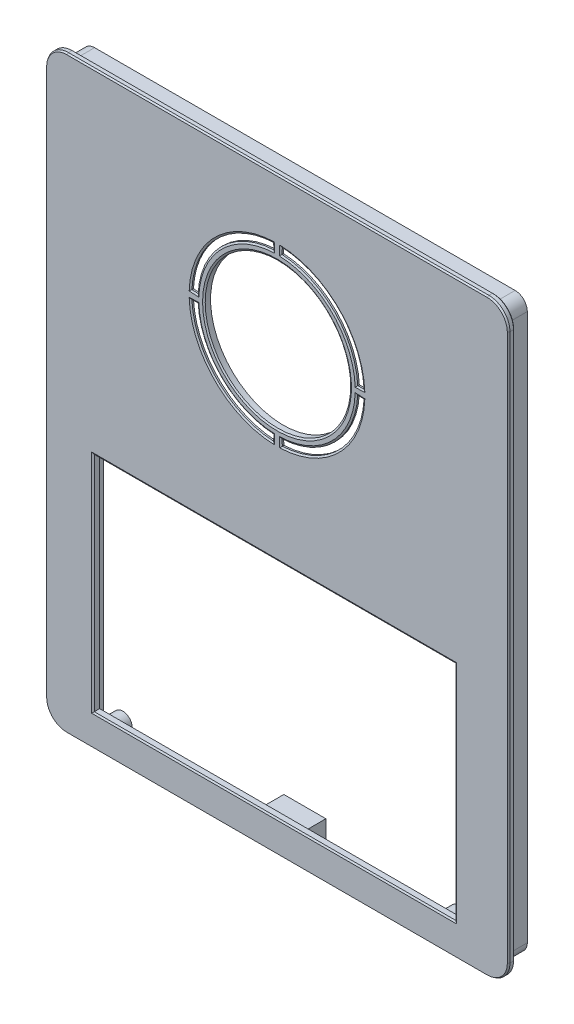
from build123d import *
from OCP.BRepFilletAPI import BRepFilletAPI_MakeChamfer

# Parameters (mm, degrees)
AUFSATZ_LINEAR_AUSTRAGEN1_DEPTH      = 3
SKIZZE2_W                            = 172
SKIZZE2_H                            = 106
SCREEN_CUTOUT_DEPTH                  = 179.070210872
SKIZZE3_R                            = 34.6
CAM_LENS_CUTOUT_DEPTH                = 179.070210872
SCHNITT_LINEAR_AUSTRAGEN_D_NN1_DEPTH = 179.070210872
SKIZZE57_R                           = 44
SKIZZE57_R_2                         = 35
SCHNITT_LINEAR_AUSTRAGEN6_DEPTH      = 1.8
SKIZZE72_R                           = 4.5
AUFSATZ_LINEAR_AUSTRAGEN20_DEPTH     = 5
F_4_2_4_2_DURCHMESSER_BOHRUNG2_D     = 4.2
F_4_2_4_2_DURCHMESSER_BOHRUNG2_DEPTH = 6
AUFSATZ_LINEAR_AUSTRAGEN21_DEPTH     = 10.25
SKIZZE88_W                           = 191.6
SKIZZE88_H                           = 2.4
AUFSATZ_LINEAR_AUSTRAGEN23_DEPTH     = 4
SKIZZE92_W                           = 20
SKIZZE92_H                           = 9
AUFSATZ_LINEAR_AUSTRAGEN24_DEPTH     = 10.25
SCHNITT_LINEAR_AUSTRAGEN_D_NN3_START = 25
SKIZZE81_R                           = 5
SKIZZE81_R_2                         = 2.5
SCHNITT_LINEAR_AUSTRAGEN_D_NN3_DEPTH = 2.25
LINEARES_MUSTER6_COUNT               = 2
LINEARES_MUSTER6_PITCH               = 50
LINEARES_MUSTER6_COL_COUNT           = 3
LINEARES_MUSTER6_COL_PITCH           = 50
SPIEGELN1_START                      = 25
SPIEGELN1_COPY_1_SKETCH_R            = 5
SPIEGELN1_COPY_1_SKETCH_R_2          = 2.5
SPIEGELN1_COPY_1_DEPTH               = 2.25
SPIEGELN1_COPY_2_SKETCH_R            = 5
SPIEGELN1_COPY_2_SKETCH_R_2          = 2.5
SPIEGELN1_COPY_2_DEPTH               = 2.25
SPIEGELN1_COPY_3_SKETCH_R            = 5
SPIEGELN1_COPY_3_SKETCH_R_2          = 2.5
SPIEGELN1_COPY_3_DEPTH               = 2.25
F_4_2_4_2_DURCHMESSER_BOHRUNG3_D     = 4.2
F_4_2_4_2_DURCHMESSER_BOHRUNG3_DEPTH = 7
LINEARES_MUSTER3_COUNT               = 2
LINEARES_MUSTER3_PITCH               = 50
LINEARES_MUSTER3_COL_COUNT           = 3
LINEARES_MUSTER3_COL_PITCH           = 50
F_4_2_4_2_DURCHMESSER_BOHRUNG4_D     = 4.2
F_4_2_4_2_DURCHMESSER_BOHRUNG4_DEPTH = 7
LINEARES_MUSTER5_COUNT               = 5
LINEARES_MUSTER5_PITCH               = 50
SKIZZE85_R                           = 7.5
AUFSATZ_LINEAR_AUSTRAGEN22_DEPTH     = 10
LINEAR_AUSTRAGEN_D_NN7_DEPTH         = 6
F_4_2_4_2_DURCHMESSER_BOHRUNG5_D     = 4.2
F_4_2_4_2_DURCHMESSER_BOHRUNG5_DEPTH = 7
FASE10_SIZE                          = 0.6
FASE6_SIZE                           = 0.8
FASE6_SIZE2                          = 0.461880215
FASE11_SIZE                          = 0.5
F_4_2_4_2_DURCHMESSER_BOHRUNG6_D     = 4.2
F_4_2_4_2_DURCHMESSER_BOHRUNG6_DEPTH = 8


with BuildPart() as part:
    # Skizze1 → Aufsatz-Linear austragen1 (new body)
    with BuildSketch(Plane.XY):
        with BuildLine():
            Line((-100, 140), (100, 140))
            ThreePointArc((100, 140), (107.071067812, 137.071067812), (110, 130))
            Line((110, 130), (110, -130))
            ThreePointArc((110, -130), (107.071067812, -137.071067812), (100, -140))
            Line((100, -140), (-100, -140))
            ThreePointArc((-100, -140), (-107.071067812, -137.071067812), (-110, -130))
            Line((-110, -130), (-110, 130))
            ThreePointArc((-110, 130), (-107.071067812, 137.071067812), (-100, 140))
        make_face()
    extrude(amount=-AUFSATZ_LINEAR_AUSTRAGEN1_DEPTH)

    # Skizze2 → screen-cutout (cut, through all)
    with BuildSketch(Plane.XY):
        with Locations((-1.359461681, -72)):
            Rectangle(SKIZZE2_W, SKIZZE2_H)
    extrude(amount=-SCREEN_CUTOUT_DEPTH, mode=Mode.SUBTRACT)

    # Skizze3 → cam-lens-cutout (cut, through all)
    with BuildSketch(Plane.XY):
        with Locations((0, 70)):
            Circle(SKIZZE3_R)
    extrude(amount=-CAM_LENS_CUTOUT_DEPTH, mode=Mode.SUBTRACT)

    # Skizze52 → Schnitt-Linear-Austragen-D_nn1 (cut, through all)
    with BuildSketch(Plane(origin=(0, 0, -3), x_dir=(-1, 0, 0), z_dir=(0, 0, -1))):
        with BuildLine():
            ThreePointArc((1.924050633, 107.951258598), (26.870057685, 96.870057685), (37.951258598, 71.924050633))
            Line((37.951258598, 71.924050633), (40.947410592, 72.075949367))
            ThreePointArc((40.947410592, 72.075949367), (28.991378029, 98.991378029), (2.075949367, 110.947410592))
            Line((2.075949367, 110.947410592), (1.924050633, 107.951258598))
        make_face()
        with BuildLine():
            ThreePointArc((37.951258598, 68.075949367), (26.870057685, 43.129942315), (1.924050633, 32.048741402))
            Line((1.924050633, 32.048741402), (2.075949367, 29.052589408))
            ThreePointArc((2.075949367, 29.052589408), (28.991378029, 41.008621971), (40.947410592, 67.924050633))
            Line((40.947410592, 67.924050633), (37.951258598, 68.075949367))
        make_face()
        with BuildLine():
            ThreePointArc((-1.924050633, 32.048741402), (-26.870057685, 43.129942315), (-37.951258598, 68.075949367))
            Line((-37.951258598, 68.075949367), (-40.947410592, 67.924050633))
            ThreePointArc((-40.947410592, 67.924050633), (-28.991378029, 41.008621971), (-2.075949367, 29.052589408))
            Line((-2.075949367, 29.052589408), (-1.924050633, 32.048741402))
        make_face()
        with BuildLine():
            ThreePointArc((-37.951258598, 71.924050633), (-26.870057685, 96.870057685), (-1.924050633, 107.951258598))
            Line((-1.924050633, 107.951258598), (-2.075949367, 110.947410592))
            ThreePointArc((-2.075949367, 110.947410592), (-28.991378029, 98.991378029), (-40.947410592, 72.075949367))
            Line((-40.947410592, 72.075949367), (-37.951258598, 71.924050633))
        make_face()
    extrude(amount=-SCHNITT_LINEAR_AUSTRAGEN_D_NN1_DEPTH, mode=Mode.SUBTRACT)

    # Skizze57 → Schnitt-Linear austragen6 (cut)
    with BuildSketch(Plane(origin=(0, 0, -3), x_dir=(-1, 0, 0), z_dir=(0, 0, -1))):
        with Locations((0, 70)):
            Circle(SKIZZE57_R)
        with Locations((0, 70)):
            Circle(SKIZZE57_R_2, mode=Mode.SUBTRACT)
    extrude(amount=-SCHNITT_LINEAR_AUSTRAGEN6_DEPTH, mode=Mode.SUBTRACT)

    # Skizze72 → Aufsatz-Linear austragen20 (add)
    with BuildSketch(Plane(origin=(0, 0, -3), x_dir=(-1, 0, 0), z_dir=(0, 0, -1))):
        with Locations((-78.640538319, -14)):
            Circle(SKIZZE72_R)
        with Locations((-78.640538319, -130)):
            Circle(SKIZZE72_R)
        with Locations((81.359461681, -130)):
            Circle(SKIZZE72_R)
        with Locations((81.359461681, -14)):
            Circle(SKIZZE72_R)
    extrude(amount=AUFSATZ_LINEAR_AUSTRAGEN20_DEPTH)

    # 4.2 _4.2_ Durchmesser Bohrung2
    with Locations(Plane(origin=(0, 0, -8), x_dir=(-1, 0, 0), z_dir=(0, 0, -1))):
        with Locations((-78.640538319, -14), (-78.640538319, -130), (81.359461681, -130), (81.359461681, -14)):
            Hole(F_4_2_4_2_DURCHMESSER_BOHRUNG2_D / 2, depth=F_4_2_4_2_DURCHMESSER_BOHRUNG2_DEPTH)

    # Skizze77 → Aufsatz-Linear austragen21 (add)
    with BuildSketch(Plane(origin=(0, 0, -3), x_dir=(-1, 0, 0), z_dir=(0, 0, -1))):
        with BuildLine():
            Line((95.8, -135.8), (100, -135.8))
            ThreePointArc((100, -135.8), (104.101219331, -134.101219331), (105.8, -130))
            Line((105.8, -130), (105.8, 130))
            ThreePointArc((105.8, 130), (104.101219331, 134.101219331), (100, 135.8))
            Line((100, 135.8), (-100, 135.8))
            ThreePointArc((-100, 135.8), (-104.101219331, 134.101219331), (-105.8, 130))
            Line((-105.8, 130), (-105.8, -130))
            ThreePointArc((-105.8, -130), (-104.101219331, -134.101219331), (-100, -135.8))
            Line((-100, -135.8), (-95.8, -135.8))
            Line((-95.8, -135.8), (-95.8, 125.8))
            Line((-95.8, 125.8), (95.8, 125.8))
            Line((95.8, 125.8), (95.8, -135.8))
        make_face()
    extrude(amount=AUFSATZ_LINEAR_AUSTRAGEN21_DEPTH)

    # Skizze88 → Aufsatz-Linear austragen23 (add)
    with BuildSketch(Plane(origin=(0, 0, -3), x_dir=(-1, 0, 0), z_dir=(0, 0, -1))):
        with Locations((0, -134.6)):
            Rectangle(SKIZZE88_W, SKIZZE88_H)
    extrude(amount=AUFSATZ_LINEAR_AUSTRAGEN23_DEPTH)

    # Skizze92 → Aufsatz-Linear austragen24 (add)
    with BuildSketch(Plane(origin=(0, 0, -3), x_dir=(-1, 0, 0), z_dir=(0, 0, -1))):
        with Locations((0, -131.3)):
            Rectangle(SKIZZE92_W, SKIZZE92_H)
    extrude(amount=AUFSATZ_LINEAR_AUSTRAGEN24_DEPTH)

    # Skizze81 → Schnitt-Linear-Austragen-D_nn3 (cut, symmetric)
    with BuildSketch(Plane(origin=(-23.6, 0, 0), x_dir=(1, 0, 0), z_dir=(0, 1, 0)).offset(SCHNITT_LINEAR_AUSTRAGEN_D_NN3_START)):
        with Locations((-72.2, 13.25)):
            Circle(SKIZZE81_R)
        with Locations((-72.2, 13.25)):
            Circle(SKIZZE81_R_2, mode=Mode.SUBTRACT)
    schnitt_linear_austragen_d_nn3 = extrude(amount=SCHNITT_LINEAR_AUSTRAGEN_D_NN3_DEPTH, both=True, mode=Mode.SUBTRACT)

    # Lineares Muster6: Schnitt-Linear-Austragen-D_nn3 ×2
    with Locations(*[(0, i * LINEARES_MUSTER6_PITCH, 0) for i in range(1, LINEARES_MUSTER6_COUNT)]):
        add(schnitt_linear_austragen_d_nn3, mode=Mode.SUBTRACT)

    # Lineares Muster6 col: Schnitt-Linear-Austragen-D_nn3 ×3
    with Locations(*[(0, -i * LINEARES_MUSTER6_COL_PITCH, 0) for i in range(1, LINEARES_MUSTER6_COL_COUNT)]):
        add(schnitt_linear_austragen_d_nn3, mode=Mode.SUBTRACT)

    # Spiegeln1: Schnitt-Linear-Austragen-D_nn3 across plane
    add(schnitt_linear_austragen_d_nn3.mirror(Plane(origin=(0, 0, 0), x_dir=(0, 0, 1), z_dir=(1, 0, 0))), mode=Mode.SUBTRACT)

    # Spiegeln1 copy 1 sketch → Spiegeln1 copy 1 (cut, symmetric)
    with BuildSketch(Plane(origin=(23.6, 50, 0), x_dir=(-1, 0, 0), z_dir=(0, 1, 0)).offset(SPIEGELN1_START)):
        with Locations((-72.2, -13.25)):
            Circle(SPIEGELN1_COPY_1_SKETCH_R)
        with Locations((-72.2, -13.25)):
            Circle(SPIEGELN1_COPY_1_SKETCH_R_2, mode=Mode.SUBTRACT)
    extrude(amount=SPIEGELN1_COPY_1_DEPTH, both=True, mode=Mode.SUBTRACT)

    # Spiegeln1 copy 2 sketch → Spiegeln1 copy 2 (cut, symmetric)
    with BuildSketch(Plane(origin=(23.6, -50, 0), x_dir=(-1, 0, 0), z_dir=(0, 1, 0)).offset(SPIEGELN1_START)):
        with Locations((-72.2, -13.25)):
            Circle(SPIEGELN1_COPY_2_SKETCH_R)
        with Locations((-72.2, -13.25)):
            Circle(SPIEGELN1_COPY_2_SKETCH_R_2, mode=Mode.SUBTRACT)
    extrude(amount=SPIEGELN1_COPY_2_DEPTH, both=True, mode=Mode.SUBTRACT)

    # Spiegeln1 copy 3 sketch → Spiegeln1 copy 3 (cut, symmetric)
    with BuildSketch(Plane(origin=(23.6, -100, 0), x_dir=(-1, 0, 0), z_dir=(0, 1, 0)).offset(SPIEGELN1_START)):
        with Locations((-72.2, -13.25)):
            Circle(SPIEGELN1_COPY_3_SKETCH_R)
        with Locations((-72.2, -13.25)):
            Circle(SPIEGELN1_COPY_3_SKETCH_R_2, mode=Mode.SUBTRACT)
    extrude(amount=SPIEGELN1_COPY_3_DEPTH, both=True, mode=Mode.SUBTRACT)

    # 4.2 _4.2_ Durchmesser Bohrung3
    with Locations(Plane(origin=(0, 0, -13.25), x_dir=(-1, 0, 0), z_dir=(0, 0, -1))):
        with Locations((-25, 130.8)):
            f_4_2_4_2_durchmesser_bohrung3 = Hole(F_4_2_4_2_DURCHMESSER_BOHRUNG3_D / 2, depth=F_4_2_4_2_DURCHMESSER_BOHRUNG3_DEPTH)

    # Lineares Muster3: 4.2 _4.2_ Durchmesser Bohrung3 ×2
    with Locations(*[(i * LINEARES_MUSTER3_PITCH, 0, 0) for i in range(1, LINEARES_MUSTER3_COUNT)]):
        add(f_4_2_4_2_durchmesser_bohrung3, mode=Mode.SUBTRACT)

    # Lineares Muster3 col: 4.2 _4.2_ Durchmesser Bohrung3 ×3
    with Locations(*[(-i * LINEARES_MUSTER3_COL_PITCH, 0, 0) for i in range(1, LINEARES_MUSTER3_COL_COUNT)]):
        add(f_4_2_4_2_durchmesser_bohrung3, mode=Mode.SUBTRACT)

    # 4.2 _4.2_ Durchmesser Bohrung4
    with Locations(Plane(origin=(0, 0, -13.25), x_dir=(-1, 0, 0), z_dir=(0, 0, -1))):
        with Locations((-100.8, 110.8), (100.8, 110.8)):
            f_4_2_4_2_durchmesser_bohrung4 = Hole(F_4_2_4_2_DURCHMESSER_BOHRUNG4_D / 2, depth=F_4_2_4_2_DURCHMESSER_BOHRUNG4_DEPTH)

    # Lineares Muster5: 4.2 _4.2_ Durchmesser Bohrung4 ×5
    with Locations(*[(0, -i * LINEARES_MUSTER5_PITCH, 0) for i in range(1, LINEARES_MUSTER5_COUNT)]):
        add(f_4_2_4_2_durchmesser_bohrung4, mode=Mode.SUBTRACT)

    # Skizze85 → Aufsatz-Linear austragen22 (add)
    with BuildSketch(Plane(origin=(0, 0, -3), x_dir=(-1, 0, 0), z_dir=(0, 0, -1))):
        with Locations((-65, 102.5)):
            Circle(SKIZZE85_R)
        with Locations((-65, 37.5)):
            Circle(SKIZZE85_R)
        with Locations((65, 37.5)):
            Circle(SKIZZE85_R)
        with Locations((65, 102.5)):
            Circle(SKIZZE85_R)
    extrude(amount=AUFSATZ_LINEAR_AUSTRAGEN22_DEPTH)

    # Skizze93 → Linear-Austragen-D_nn7 (add)
    with BuildSketch(Plane(origin=(0, 0, -3), x_dir=(-1, 0, 0), z_dir=(0, 0, -1))):
        with BuildLine():
            Line((-95.8, 34), (-66.598381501, 34))
            ThreePointArc((-66.598381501, 34), (-62.796521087, 36.0925413), (-62.530460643, 40.42406338))
            ThreePointArc((-62.530460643, 40.42406338), (-68.139884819, 81.90590744), (-48.796237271, 119.027765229))
            ThreePointArc((-48.796237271, 119.027765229), (-47.815260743, 120.490273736), (-47.470677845, 122.217267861))
            Line((-47.470677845, 122.217267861), (-47.470677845, 125.8))
            Line((-47.470677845, 125.8), (-54.470677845, 125.8))
            Line((-54.470677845, 125.8), (-54.470677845, 123.24613338))
            ThreePointArc((-54.470677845, 123.24613338), (-74.776435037, 84.515172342), (-70.435825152, 41))
            Line((-70.435825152, 41), (-95.8, 41))
            Line((-95.8, 41), (-95.8, 34))
        make_face()
        with BuildLine():
            Line((95.8, 41), (70.435825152, 41))
            ThreePointArc((70.435825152, 41), (74.776435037, 84.515172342), (54.470677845, 123.24613338))
            Line((54.470677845, 123.24613338), (54.470677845, 125.8))
            Line((54.470677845, 125.8), (47.470677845, 125.8))
            Line((47.470677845, 125.8), (47.470677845, 122.217267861))
            ThreePointArc((47.470677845, 122.217267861), (47.815260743, 120.490273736), (48.796237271, 119.027765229))
            ThreePointArc((48.796237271, 119.027765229), (68.139884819, 81.90590744), (62.530460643, 40.42406338))
            ThreePointArc((62.530460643, 40.42406338), (62.796521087, 36.0925413), (66.598381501, 34))
            Line((66.598381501, 34), (95.8, 34))
            Line((95.8, 34), (95.8, 41))
        make_face()
    extrude(amount=LINEAR_AUSTRAGEN_D_NN7_DEPTH)

    # 4.2 _4.2_ Durchmesser Bohrung5
    with Locations(Plane(origin=(0, 0, -13), x_dir=(-1, 0, 0), z_dir=(0, 0, -1))):
        with Locations((-65, 102.5), (-65, 37.5), (65, 37.5), (65, 102.5)):
            Hole(F_4_2_4_2_DURCHMESSER_BOHRUNG5_D / 2, depth=F_4_2_4_2_DURCHMESSER_BOHRUNG5_DEPTH)

    # Fase10
    fase10_edges = [part.edges().sort_by_distance(p)[0] for p in [
        (-67.1, 102.5, -13),
        (-67.1, 37.5, -13),
        (62.9, 37.5, -13),
        (62.9, 102.5, -13),
    ]]
    chamfer(fase10_edges, length=FASE10_SIZE)

    # Fase6: one chamfer whose edges measure the first distance from different faces: ONE call of the kernel's chamfer builder (chamfer() names one face for all edges)
    fase6_edges_1 = [part.edges().sort_by_distance(p)[0] for p in [
        (-110, 0, 0),
    ]]
    fase6_side_1 = [part.faces().sort_by_distance(p)[0] for p in [
        (-110, 0, -1.5),
    ]]
    fase6_edges_2 = [part.edges().sort_by_distance(p)[0] for p in [
        (-107.071067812, 137.071067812, 0),
    ]]
    fase6_side_2 = [part.faces().sort_by_distance(p)[0] for p in [
        (-107.071067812, 137.071067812, -1.5),
    ]]
    fase6_edges_3 = [part.edges().sort_by_distance(p)[0] for p in [
        (0, 140, 0),
    ]]
    fase6_side_3 = [part.faces().sort_by_distance(p)[0] for p in [
        (0, 140, -1.5),
    ]]
    fase6_edges_4 = [part.edges().sort_by_distance(p)[0] for p in [
        (107.071067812, 137.071067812, 0),
    ]]
    fase6_side_4 = [part.faces().sort_by_distance(p)[0] for p in [
        (107.071067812, 137.071067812, -1.5),
    ]]
    fase6_edges_5 = [part.edges().sort_by_distance(p)[0] for p in [
        (84.640538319, -72, 0),
        (-1.359461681, -19, 0),
        (-87.359461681, -72, 0),
        (-1.359461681, -125, 0),
        (-34.6, 70, 0),
        (26.870057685, 96.870057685, 0),
        (39.449334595, 72, 0),
        (28.991378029, 98.991378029, 0),
        (2, 109.449334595, 0),
        (26.870057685, 43.129942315, 0),
        (2, 30.550665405, 0),
        (28.991378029, 41.008621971, 0),
        (39.449334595, 68, 0),
        (-26.870057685, 43.129942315, 0),
        (-39.449334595, 68, 0),
        (-28.991378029, 41.008621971, 0),
        (-2, 30.550665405, 0),
        (-26.870057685, 96.870057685, 0),
        (-2, 109.449334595, 0),
        (-28.991378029, 98.991378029, 0),
        (-39.449334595, 72, 0),
    ]]
    fase6_side_5 = [part.faces().sort_by_distance(p)[0] for p in [
        (0.638401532, 25.774285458, 0),
    ]]
    fase6_edges_6 = [part.edges().sort_by_distance(p)[0] for p in [
        (110, 0, 0),
    ]]
    fase6_side_6 = [part.faces().sort_by_distance(p)[0] for p in [
        (110, 0, -1.5),
    ]]
    fase6_edges_7 = [part.edges().sort_by_distance(p)[0] for p in [
        (107.071067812, -137.071067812, 0),
    ]]
    fase6_side_7 = [part.faces().sort_by_distance(p)[0] for p in [
        (107.071067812, -137.071067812, -1.5),
    ]]
    fase6_edges_8 = [part.edges().sort_by_distance(p)[0] for p in [
        (0, -140, 0),
    ]]
    fase6_side_8 = [part.faces().sort_by_distance(p)[0] for p in [
        (0, -140, -1.5),
    ]]
    fase6_edges_9 = [part.edges().sort_by_distance(p)[0] for p in [
        (-107.071067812, -137.071067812, 0),
    ]]
    fase6_side_9 = [part.faces().sort_by_distance(p)[0] for p in [
        (-107.071067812, -137.071067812, -1.5),
    ]]
    fase6 = BRepFilletAPI_MakeChamfer(part.part.solid().wrapped)
    for e in fase6_edges_1:
        fase6.Add(FASE6_SIZE, FASE6_SIZE2, e.wrapped, fase6_side_1[0].wrapped)  # the first distance lies on this face
    for e in fase6_edges_2:
        fase6.Add(FASE6_SIZE, FASE6_SIZE2, e.wrapped, fase6_side_2[0].wrapped)  # the first distance lies on this face
    for e in fase6_edges_3:
        fase6.Add(FASE6_SIZE, FASE6_SIZE2, e.wrapped, fase6_side_3[0].wrapped)  # the first distance lies on this face
    for e in fase6_edges_4:
        fase6.Add(FASE6_SIZE, FASE6_SIZE2, e.wrapped, fase6_side_4[0].wrapped)  # the first distance lies on this face
    for e in fase6_edges_5:
        fase6.Add(FASE6_SIZE, FASE6_SIZE2, e.wrapped, fase6_side_5[0].wrapped)  # the first distance lies on this face
    for e in fase6_edges_6:
        fase6.Add(FASE6_SIZE, FASE6_SIZE2, e.wrapped, fase6_side_6[0].wrapped)  # the first distance lies on this face
    for e in fase6_edges_7:
        fase6.Add(FASE6_SIZE, FASE6_SIZE2, e.wrapped, fase6_side_7[0].wrapped)  # the first distance lies on this face
    for e in fase6_edges_8:
        fase6.Add(FASE6_SIZE, FASE6_SIZE2, e.wrapped, fase6_side_8[0].wrapped)  # the first distance lies on this face
    for e in fase6_edges_9:
        fase6.Add(FASE6_SIZE, FASE6_SIZE2, e.wrapped, fase6_side_9[0].wrapped)  # the first distance lies on this face
    add(Compound.cast(fase6.Shape()), mode=Mode.REPLACE)

    # Fase11
    fase11_edges = [part.edges().sort_by_distance(p)[0] for p in [
        (-107.071067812, 137.071067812, -3),
        (-110, 0, -3),
        (-107.071067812, -137.071067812, -3),
        (0, -140, -3),
        (107.071067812, -137.071067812, -3),
        (110, 0, -3),
        (107.071067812, 137.071067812, -3),
        (0, 140, -3),
    ]]
    chamfer(fase11_edges, length=FASE11_SIZE)

    # 4.2 _4.2_ Durchmesser Bohrung6
    with Locations(Plane(origin=(0, 0, -13.25), x_dir=(-1, 0, 0), z_dir=(0, 0, -1))):
        with Locations((-100.9, 130.9), (-100.9, 0), (-100.9, -130.9), (0, 130.9), (100.9, 130.9), (100.9, 0), (100.9, -130.9), (0, -130.9)):
            Hole(F_4_2_4_2_DURCHMESSER_BOHRUNG6_D / 2, depth=F_4_2_4_2_DURCHMESSER_BOHRUNG6_DEPTH)


solid = part.part
